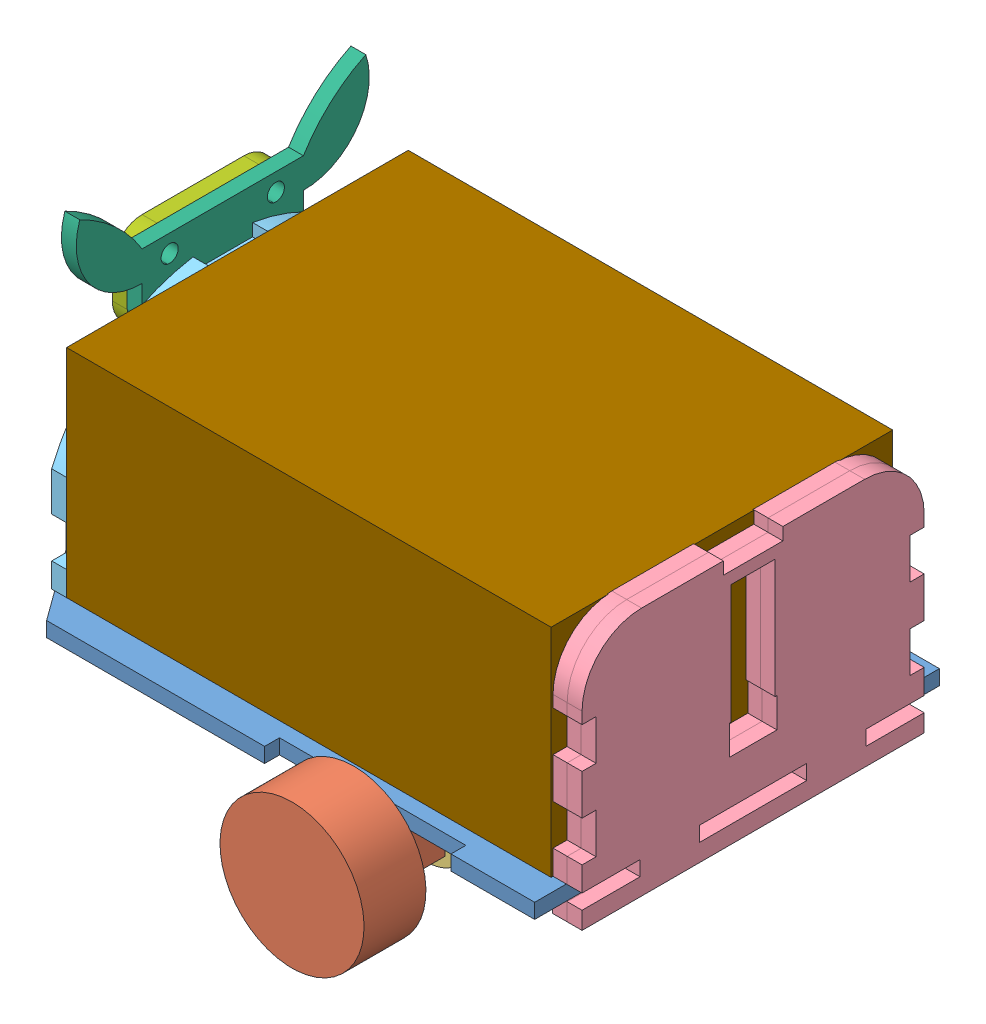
SolidWorks assembly steer.SLDASM, configuration Default (file format 4100). Lengths in mm.
Overall size (132.89 88.84 115.33).
12 component instances, 9 part files, 26 mates.
Components (placement in the parent):
- steer_base-1: steer_base.SLDPRT [Default] at (24.6752 -20.1453 4.9004) size (129.54 3.17 86.36)
- solar_motor-1: solar_motor.SLDPRT [Default] at (42.0859 -25.1872 -26.0963) x (1 0 0) z (0 1 0) size (30.73 41.4 30.73)
- solar_motor_mount-1: solar_motor_mount.SLDPRT [Default] at (91.3547 -42.4751 -19.3823) x (1 0 0) z (0 1 0) size (19.89 3.17 21.09)
- solar_motor-3: solar_motor.SLDPRT [Default] at (42.0859 -25.1872 35.897) x (1 0 0) z (0 -1 0) size (30.73 41.4 30.73)
- solar_motor_mount-3: solar_motor_mount.SLDPRT [Default] at (91.3547 -42.4751 35.3547) x (1 0 0) z (0 1 0) size (19.89 3.17 21.09)
- steer_back_v2-1: steer_back_v2.SLDPRT [Default] at (82.7273 -5.1453 4.8214) x (0 0 1) z (0 -1 0) size (73 3.17 53.22)
- steer_back_v2-2: steer_back_v2.SLDPRT [Default] at (76.3773 -5.1453 4.8214) x (0 0 -1) z (0 -1 0) size (73 3.17 53.22)
- steer_front-1: steer_front.SLDPRT [Default] at (-26.8491 -5.1453 5.2306) x (0 0 1) z (0 -1 0) size (73 3.17 49.48)
- steer_head-1: steer_head.SLDPRT [Default] at (-30.0241 -5.1453 5.2306) x (0 0 1) z (0 -1 0) size (62.51 3.17 31.18)
- steer_head2-1: steer_head2.SLDPRT [Default] at (-33.1991 -5.1453 5.2306) x (0 0 1) z (0 -1 0) size (34.42 3.17 19.14)
- steer_nose-1: steer_nose.SLDPRT [Default] at (-39.5491 43.8955 5.2306) x (0 0 1) z (0 1 0) size (17.44 3.17 11.09)
- body-1: body.SLDPRT [Default] at (24.8399 -16.9703 5.2816) size (103.38 46.23 72.9)
Mates (geometry in assembly coordinates):
- Coincident3: coincident anti-aligned: plane of solar_motor_mount-1 through (41.9265 -25.358 -20.8806) normal (0 0 1); plane of steer_base-1 through (31.9824 -20.1453 -20.8806) normal (0 0 -1)
- Coincident6: coincident anti-aligned: plane of solar_motor_mount-1 through (31.9824 -25.358 -20.8806) normal (-1 0 0); plane of steer_base-1 through (31.9824 -20.1453 -20.8806) normal (1 0 0)
- Coincident7: coincident anti-aligned: plane of steer_base-1 through (-106.2766 -20.1453 4.9004) normal (0 -1 0); plane of solar_motor-1 through (36.1169 -20.1453 -34.9863) normal (0 1 0)
- Coincident8: coincident anti-aligned: plane of solar_motor-1 through (36.1169 -30.2291 -34.9863) normal (0 -1 0); plane of solar_motor_mount-1 through (45.0715 -30.2291 -20.8806) normal (0 1 0)
- Coincident10: coincident anti-aligned: plane of steer_base-1 through (-106.2766 -20.1453 4.9004) normal (0 -1 0); plane of steer_back_v2-2 through (79.5523 -20.1453 16.2514) normal (0 1 0)
- Coincident11: coincident anti-aligned: plane of steer_base-1 through (76.3773 -16.9703 4.9004) normal (1 0 0); plane of steer_back_v2-2 through (76.3773 16.6394 -18.9786) normal (-1 0 0)
- Coincident12: coincident anti-aligned: plane of steer_back_v2-1 through (79.5523 16.6394 28.6214) normal (-1 0 0); plane of steer_back_v2-2 through (79.5523 16.6394 -18.9786) normal (1 0 0)
- Coincident14: coincident aligned: plane of steer_back_v2-1 through (79.5523 -23.8762 -31.6786) normal (0 -1 0); plane of steer_back_v2-2 through (79.5523 -23.8762 41.3214) normal (0 -1 0)
- Coincident16: coincident aligned: plane of steer_back_v2-2 through (79.5523 29.3394 -1.5286) normal (0 1 0); plane of steer_back_v2-1 through (79.5523 29.3394 -1.5286) normal (0 1 0)
- Coincident17: coincident aligned: plane of steer_back_v2-1 through (79.5523 -3.1273 -31.6786) normal (0 0 -1); plane of steer_back_v2-2 through (79.5523 -3.1273 -31.6786) normal (0 0 -1)
- Coincident19: coincident anti-aligned: plane of steer_front-1 through (-30.0241 4.8301 -70.1665) normal (-1 0 0); plane of steer_base-1 through (-30.0241 -16.9703 4.9004) normal (1 0 0)
- Coincident20: coincident anti-aligned: plane of steer_base-1 through (-106.2766 -16.9703 4.9004) normal (0 1 0); plane of steer_front-1 through (-30.0241 -16.9703 -70.1665) normal (0 -1 0)
- Coincident22: coincident anti-aligned: plane of steer_base-1 through (-106.2766 -16.9703 -18.8994) normal (0 0 1); plane of steer_front-1 through (-30.0241 4.8301 -18.8994) normal (0 0 -1)
- Coincident23: coincident anti-aligned: plane of steer_head-1 through (-30.0241 23.4547 -5.6288) normal (1 0 0); plane of steer_front-1 through (-30.0241 4.8301 -70.1665) normal (-1 0 0)
- Concentric1: concentric aligned: cylinder of steer_front-1 through (-30.0241 19.3751 2.0556) axis (1 0 0) radius 1.4732; cylinder of steer_head-1 through (-33.1991 19.3751 2.0556) axis (1 0 0) radius 1.4732
- Concentric2: concentric aligned: cylinder of steer_front-1 through (-30.0241 19.3751 8.4056) axis (1 0 0) radius 1.4732; cylinder of steer_head-1 through (-33.1991 19.3751 8.4056) axis (1 0 0) radius 1.4732
- Coincident24: coincident anti-aligned: plane of steer_head2-1 through (-33.1991 29.8968 -5.6288) normal (1 0 0); plane of steer_head-1 through (-33.1991 23.4547 -5.6288) normal (-1 0 0)
- Concentric3: concentric aligned: cylinder of steer_head2-1 through (-36.3741 32.475 16.5662) axis (1 0 0) radius 1.8288; cylinder of steer_head-1 through (-33.1991 32.475 16.5662) axis (1 0 0) radius 1.8288
- Concentric4: concentric aligned: cylinder of steer_head-1 through (-33.1991 32.475 -6.1051) axis (1 0 0) radius 1.8288; cylinder of steer_head2-1 through (-36.3741 32.475 -6.1051) axis (1 0 0) radius 1.8288
- Coincident25: coincident anti-aligned: plane of steer_head2-1 through (-36.3741 29.8968 -5.6288) normal (-1 0 0); plane of steer_nose-1 through (-36.3741 19.3751 8.4056) normal (1 0 0)
- Coincident26: coincident aligned: circle of steer_head2-1; cylinder of steer_nose-1 through (-36.3741 19.3751 2.0556) axis (-1 0 0) radius 1.4732
- Coincident27: coincident anti-aligned: cylinder of steer_head2-1 through (-36.3741 19.3751 8.4056) axis (1 0 0) radius 1.4732; circle of steer_nose-1
- Coincident28: coincident anti-aligned: plane of steer_front-1 through (-26.8491 4.8301 -70.1665) normal (1 0 0); plane of body-1 through (-26.8491 29.2577 18.8563) normal (-1 0 0)
- Coincident29: coincident anti-aligned: plane of steer_base-1 through (-106.2766 -16.9703 4.9004) normal (0 1 0); plane of body-1 through (76.5289 -16.9703 -54.0417) normal (0 -1 0)
- Coincident31: coincident aligned: plane of steer_front-1 through (-30.0241 4.8301 41.7306) normal (0 0 1); plane of body-1 through (-26.8491 29.2577 41.7306) normal (0 0 1)
- PLANE1: unknown: moEndPointRef_w of steer_base-1; unknown of steer_base-1; unknown of steer_base-1
